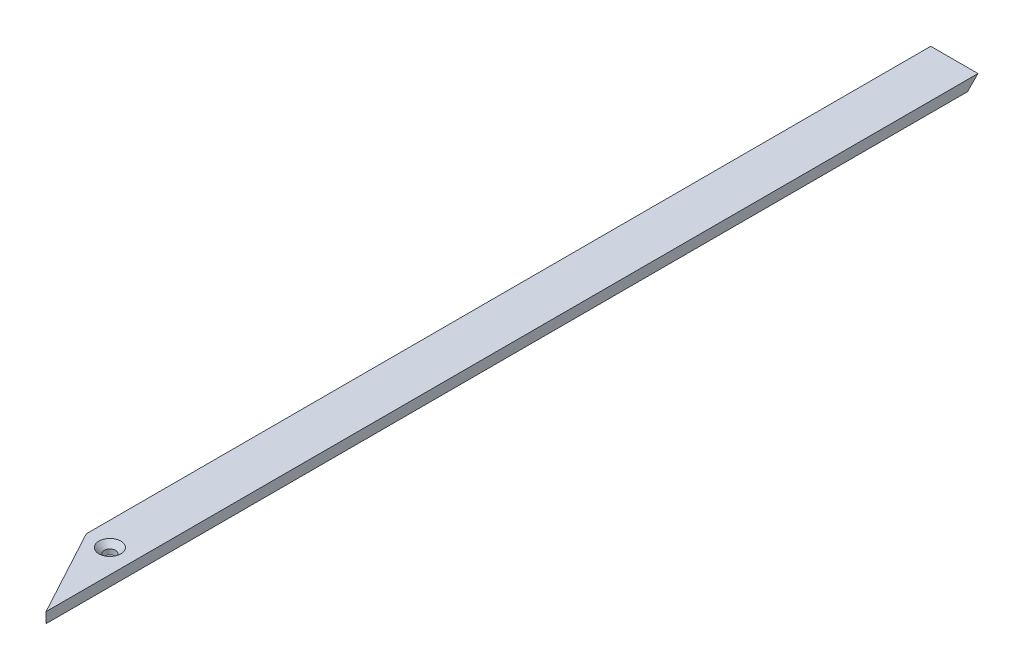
ISO-10303-21;
HEADER;
FILE_DESCRIPTION(('STEP AP214'),'2;1');
FILE_NAME('part.step','',(''),(''),'','','');
FILE_SCHEMA(('AUTOMOTIVE_DESIGN { 1 0 10303 214 1 1 1 1 }'));
ENDSEC;
DATA;
#1=APPLICATION_CONTEXT('core data for automotive mechanical design processes');
#2=APPLICATION_PROTOCOL_DEFINITION('international standard','automotive_design',2000,#1);
#3=PRODUCT_CONTEXT('',#1,'mechanical');
#4=PRODUCT('Part','Part','',(#3));
#5=PRODUCT_RELATED_PRODUCT_CATEGORY('part','',(#4));
#6=PRODUCT_DEFINITION_FORMATION('','',#4);
#7=PRODUCT_DEFINITION_CONTEXT('part definition',#1,'design');
#8=PRODUCT_DEFINITION('design','',#6,#7);
#9=PRODUCT_DEFINITION_SHAPE('','',#8);
#10=(LENGTH_UNIT() NAMED_UNIT(*) SI_UNIT(.MILLI.,.METRE.));
#11=(NAMED_UNIT(*) PLANE_ANGLE_UNIT() SI_UNIT($,.RADIAN.));
#12=(NAMED_UNIT(*) SI_UNIT($,.STERADIAN.) SOLID_ANGLE_UNIT());
#13=UNCERTAINTY_MEASURE_WITH_UNIT(LENGTH_MEASURE(1.E-05),#10,'distance_accuracy_value','');
#14=(GEOMETRIC_REPRESENTATION_CONTEXT(3) GLOBAL_UNCERTAINTY_ASSIGNED_CONTEXT((#13)) GLOBAL_UNIT_ASSIGNED_CONTEXT((#10,
#11,#12)) REPRESENTATION_CONTEXT('',''));
#15=CARTESIAN_POINT('',(0.,0.,0.));
#16=DIRECTION('',(0.,0.,1.));
#17=DIRECTION('',(1.,0.,0.));
#18=AXIS2_PLACEMENT_3D('',#15,#16,#17);
#19=CARTESIAN_POINT('',(-13.5,0.,266.25));
#20=DIRECTION('',(1.,0.,0.));
#21=DIRECTION('',(0.,0.,-1.));
#22=AXIS2_PLACEMENT_3D('',#19,#20,#21);
#23=PLANE('',#22);
#24=DIRECTION('',(0.,0.,-1.));
#25=VECTOR('',#24,1.);
#26=CARTESIAN_POINT('',(-13.5,6.,266.25));
#27=LINE('',#26,#25);
#28=CARTESIAN_POINT('',(-13.5,6.,216.25));
#29=VERTEX_POINT('',#28);
#30=CARTESIAN_POINT('',(-13.5,6.,-266.25));
#31=VERTEX_POINT('',#30);
#32=EDGE_CURVE('E93',#29,#31,#27,.T.);
#33=ORIENTED_EDGE('',*,*,#32,.T.);
#34=DIRECTION('',(0.,-0.707106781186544,0.707106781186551));
#35=VECTOR('',#34,1.);
#36=CARTESIAN_POINT('',(-13.5,0.,-260.25));
#37=LINE('',#36,#35);
#38=CARTESIAN_POINT('',(-13.5,0.,-260.25));
#39=VERTEX_POINT('',#38);
#40=EDGE_CURVE('E11',#31,#39,#37,.T.);
#41=ORIENTED_EDGE('',*,*,#40,.T.);
#42=DIRECTION('',(0.,0.,-1.));
#43=VECTOR('',#42,1.);
#44=CARTESIAN_POINT('',(-13.5,0.,266.25));
#45=LINE('',#44,#43);
#46=CARTESIAN_POINT('',(-13.5,0.,216.25));
#47=VERTEX_POINT('',#46);
#48=EDGE_CURVE('E112',#47,#39,#45,.T.);
#49=ORIENTED_EDGE('',*,*,#48,.F.);
#50=DIRECTION('',(0.,1.,0.));
#51=VECTOR('',#50,1.);
#52=CARTESIAN_POINT('',(-13.5,0.,216.25));
#53=LINE('',#52,#51);
#54=EDGE_CURVE('E118',#47,#29,#53,.T.);
#55=ORIENTED_EDGE('',*,*,#54,.T.);
#56=EDGE_LOOP('',(#33,#41,#49,#55));
#57=FACE_BOUND('',#56,.T.);
#58=ADVANCED_FACE('F36',(#57),#23,.F.);
#59=CARTESIAN_POINT('',(-13.5,0.,266.25));
#60=DIRECTION('',(0.,1.,0.));
#61=DIRECTION('',(0.,0.,1.));
#62=AXIS2_PLACEMENT_3D('',#59,#60,#61);
#63=PLANE('',#62);
#64=CARTESIAN_POINT('',(0.,0.,216.25));
#65=DIRECTION('',(0.,1.,0.));
#66=DIRECTION('',(0.,0.,1.));
#67=AXIS2_PLACEMENT_3D('',#64,#65,#66);
#68=CIRCLE('',#67,3.25);
#69=CARTESIAN_POINT('',(0.,0.,219.5));
#70=VERTEX_POINT('',#69);
#71=EDGE_CURVE('E164',#70,#70,#68,.T.);
#72=ORIENTED_EDGE('',*,*,#71,.T.);
#73=EDGE_LOOP('',(#72));
#74=FACE_BOUND('',#73,.T.);
#75=ORIENTED_EDGE('',*,*,#48,.T.);
#76=DIRECTION('',(1.,0.,0.));
#77=VECTOR('',#76,1.);
#78=CARTESIAN_POINT('',(13.5,0.,-260.25));
#79=LINE('',#78,#77);
#80=CARTESIAN_POINT('',(13.5,0.,-260.25));
#81=VERTEX_POINT('',#80);
#82=EDGE_CURVE('E84',#39,#81,#79,.T.);
#83=ORIENTED_EDGE('',*,*,#82,.T.);
#84=DIRECTION('',(0.,0.,-1.));
#85=VECTOR('',#84,1.);
#86=CARTESIAN_POINT('',(13.5,0.,266.25));
#87=LINE('',#86,#85);
#88=CARTESIAN_POINT('',(13.5,0.,266.25));
#89=VERTEX_POINT('',#88);
#90=EDGE_CURVE('E82',#89,#81,#87,.T.);
#91=ORIENTED_EDGE('',*,*,#90,.F.);
#92=DIRECTION('',(0.475148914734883,0.,0.879905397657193));
#93=VECTOR('',#92,1.);
#94=CARTESIAN_POINT('',(13.5000000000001,0.,266.25));
#95=LINE('',#94,#93);
#96=EDGE_CURVE('E115',#89,#47,#95,.F.);
#97=ORIENTED_EDGE('',*,*,#96,.T.);
#98=EDGE_LOOP('',(#75,#83,#91,#97));
#99=FACE_BOUND('',#98,.T.);
#100=ADVANCED_FACE('F125',(#74,#99),#63,.F.);
#101=CARTESIAN_POINT('',(13.5,0.,266.25));
#102=DIRECTION('',(-1.,0.,0.));
#103=DIRECTION('',(0.,0.,1.));
#104=AXIS2_PLACEMENT_3D('',#101,#102,#103);
#105=PLANE('',#104);
#106=ORIENTED_EDGE('',*,*,#90,.T.);
#107=DIRECTION('',(0.,0.707106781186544,-0.707106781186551));
#108=VECTOR('',#107,1.);
#109=CARTESIAN_POINT('',(13.5,0.,-260.25));
#110=LINE('',#109,#108);
#111=CARTESIAN_POINT('',(13.5,6.,-266.25));
#112=VERTEX_POINT('',#111);
#113=EDGE_CURVE('E44',#81,#112,#110,.T.);
#114=ORIENTED_EDGE('',*,*,#113,.T.);
#115=DIRECTION('',(0.,0.,-1.));
#116=VECTOR('',#115,1.);
#117=CARTESIAN_POINT('',(13.5,6.,266.25));
#118=LINE('',#117,#116);
#119=CARTESIAN_POINT('',(13.5,6.,266.25));
#120=VERTEX_POINT('',#119);
#121=EDGE_CURVE('E79',#120,#112,#118,.T.);
#122=ORIENTED_EDGE('',*,*,#121,.F.);
#123=DIRECTION('',(0.,1.,0.));
#124=VECTOR('',#123,1.);
#125=CARTESIAN_POINT('',(13.5,0.,266.25));
#126=LINE('',#125,#124);
#127=EDGE_CURVE('E97',#89,#120,#126,.T.);
#128=ORIENTED_EDGE('',*,*,#127,.F.);
#129=EDGE_LOOP('',(#106,#114,#122,#128));
#130=FACE_BOUND('',#129,.T.);
#131=ADVANCED_FACE('F77',(#130),#105,.F.);
#132=CARTESIAN_POINT('',(-13.5,6.,266.25));
#133=DIRECTION('',(0.,-1.,0.));
#134=DIRECTION('',(0.,0.,-1.));
#135=AXIS2_PLACEMENT_3D('',#132,#133,#134);
#136=PLANE('',#135);
#137=CARTESIAN_POINT('',(0.,6.,216.25));
#138=DIRECTION('',(0.,1.,0.));
#139=DIRECTION('',(0.,0.,1.));
#140=AXIS2_PLACEMENT_3D('',#137,#138,#139);
#141=CIRCLE('',#140,6.3);
#142=CARTESIAN_POINT('',(0.,6.,222.55));
#143=VERTEX_POINT('',#142);
#144=EDGE_CURVE('E98',#143,#143,#141,.T.);
#145=ORIENTED_EDGE('',*,*,#144,.F.);
#146=EDGE_LOOP('',(#145));
#147=FACE_BOUND('',#146,.T.);
#148=ORIENTED_EDGE('',*,*,#32,.F.);
#149=DIRECTION('',(-0.475148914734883,0.,-0.879905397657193));
#150=VECTOR('',#149,1.);
#151=CARTESIAN_POINT('',(13.5000000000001,6.,266.25));
#152=LINE('',#151,#150);
#153=EDGE_CURVE('E91',#29,#120,#152,.F.);
#154=ORIENTED_EDGE('',*,*,#153,.T.);
#155=ORIENTED_EDGE('',*,*,#121,.T.);
#156=DIRECTION('',(-1.,0.,0.));
#157=VECTOR('',#156,1.);
#158=CARTESIAN_POINT('',(-13.5,6.,-266.25));
#159=LINE('',#158,#157);
#160=EDGE_CURVE('E89',#112,#31,#159,.T.);
#161=ORIENTED_EDGE('',*,*,#160,.T.);
#162=EDGE_LOOP('',(#148,#154,#155,#161));
#163=FACE_BOUND('',#162,.T.);
#164=ADVANCED_FACE('F88',(#147,#163),#136,.F.);
#165=CARTESIAN_POINT('',(0.,6.,216.25));
#166=DIRECTION('',(0.,1.,0.));
#167=DIRECTION('',(0.,0.,1.));
#168=AXIS2_PLACEMENT_3D('',#165,#166,#167);
#169=CONICAL_SURFACE('',#168,6.3,0.785398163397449);
#170=CARTESIAN_POINT('',(0.,2.95,216.25));
#171=DIRECTION('',(0.,1.,0.));
#172=DIRECTION('',(0.,0.,1.));
#173=AXIS2_PLACEMENT_3D('',#170,#171,#172);
#174=CIRCLE('',#173,3.25);
#175=CARTESIAN_POINT('',(0.,2.95,219.5));
#176=VERTEX_POINT('',#175);
#177=EDGE_CURVE('E105',#176,#176,#174,.T.);
#178=ORIENTED_EDGE('',*,*,#177,.F.);
#179=EDGE_LOOP('',(#178));
#180=FACE_BOUND('',#179,.T.);
#181=ORIENTED_EDGE('',*,*,#144,.T.);
#182=EDGE_LOOP('',(#181));
#183=FACE_BOUND('',#182,.T.);
#184=ADVANCED_FACE('F137',(#180,#183),#169,.F.);
#185=CARTESIAN_POINT('',(0.,6.,216.25));
#186=DIRECTION('',(0.,1.,0.));
#187=DIRECTION('',(0.,0.,1.));
#188=AXIS2_PLACEMENT_3D('',#185,#186,#187);
#189=CYLINDRICAL_SURFACE('',#188,3.25);
#190=ORIENTED_EDGE('',*,*,#71,.F.);
#191=EDGE_LOOP('',(#190));
#192=FACE_BOUND('',#191,.T.);
#193=ORIENTED_EDGE('',*,*,#177,.T.);
#194=EDGE_LOOP('',(#193));
#195=FACE_BOUND('',#194,.T.);
#196=ADVANCED_FACE('F130',(#192,#195),#189,.F.);
#197=CARTESIAN_POINT('',(13.5000000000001,6.,266.25));
#198=DIRECTION('',(0.879905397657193,0.,-0.475148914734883));
#199=DIRECTION('',(-0.475148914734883,0.,-0.879905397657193));
#200=AXIS2_PLACEMENT_3D('',#197,#198,#199);
#201=PLANE('',#200);
#202=ORIENTED_EDGE('',*,*,#153,.F.);
#203=ORIENTED_EDGE('',*,*,#54,.F.);
#204=ORIENTED_EDGE('',*,*,#96,.F.);
#205=ORIENTED_EDGE('',*,*,#127,.T.);
#206=EDGE_LOOP('',(#202,#203,#204,#205));
#207=FACE_BOUND('',#206,.T.);
#208=ADVANCED_FACE('F128',(#207),#201,.F.);
#209=CARTESIAN_POINT('',(-13.5,0.,-260.25));
#210=DIRECTION('',(0.,-0.707106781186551,-0.707106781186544));
#211=DIRECTION('',(0.,0.707106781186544,-0.707106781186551));
#212=AXIS2_PLACEMENT_3D('',#209,#210,#211);
#213=PLANE('',#212);
#214=ORIENTED_EDGE('',*,*,#40,.F.);
#215=ORIENTED_EDGE('',*,*,#160,.F.);
#216=ORIENTED_EDGE('',*,*,#113,.F.);
#217=ORIENTED_EDGE('',*,*,#82,.F.);
#218=EDGE_LOOP('',(#214,#215,#216,#217));
#219=FACE_BOUND('',#218,.T.);
#220=ADVANCED_FACE('F95',(#219),#213,.T.);
#221=CLOSED_SHELL('',(#58,#100,#131,#164,#184,#196,#208,#220));
#222=MANIFOLD_SOLID_BREP('B2',#221);
#223=ADVANCED_BREP_SHAPE_REPRESENTATION('',(#18,#222),#14);
#224=SHAPE_DEFINITION_REPRESENTATION(#9,#223);
ENDSEC;
END-ISO-10303-21;
